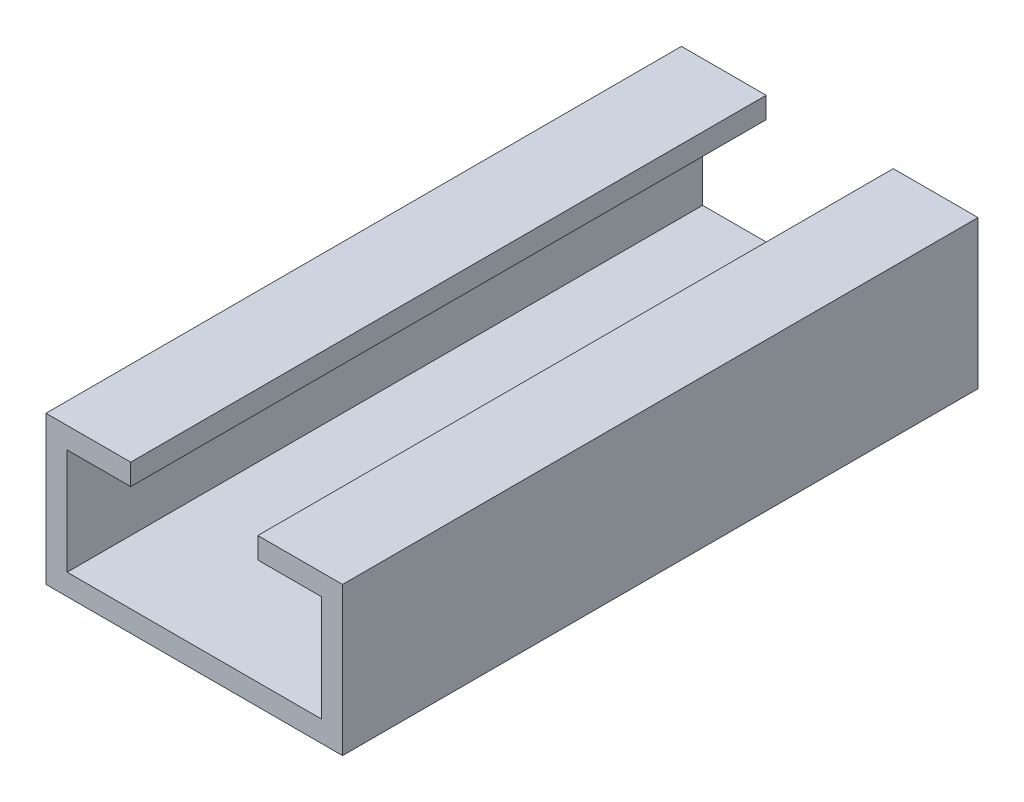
from build123d import *

# Parameters (mm, degrees)
EXTRUSION1_DEPTH = 60


with BuildPart() as part:
    # Esquisse1 → Extrusion1 (new body)
    with BuildSketch(Plane.XY):
        Polygon((-12, 12), (-6, 12), (-6, 14), (-14, 14), (-14, 0), (14, 0), (14, 14), (6, 14), (6, 12), (12, 12), (12, 2), (-12, 2), align=None)
    extrude(amount=EXTRUSION1_DEPTH)


solid = part.part
